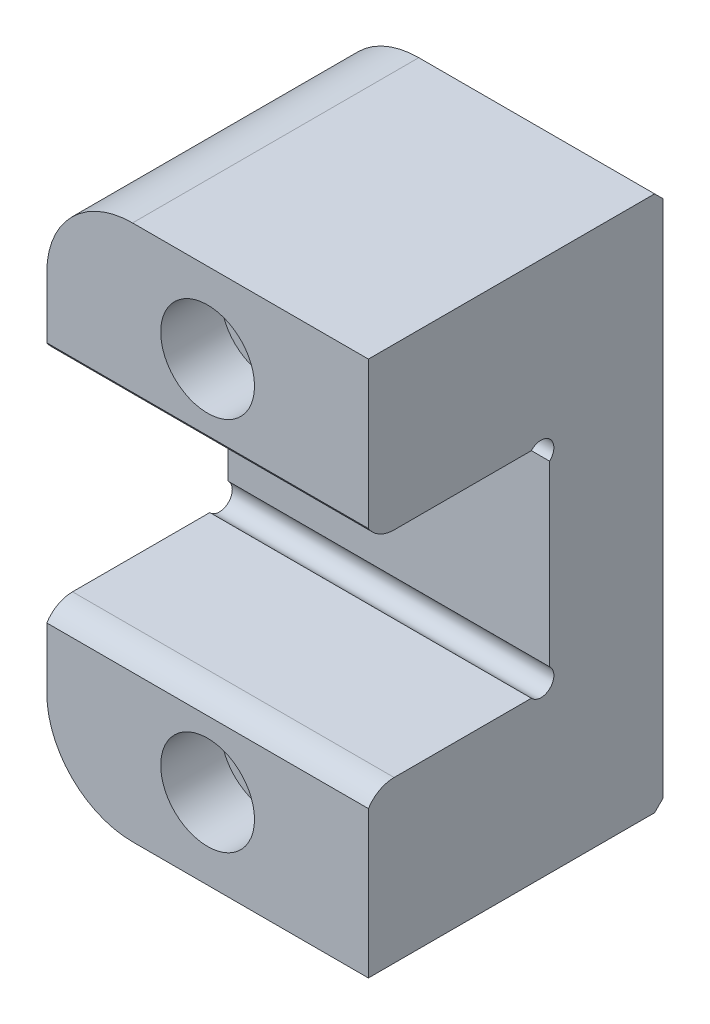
ISO-10303-21;
HEADER;
FILE_DESCRIPTION(('STEP AP214'),'2;1');
FILE_NAME('part.step','',(''),(''),'','','');
FILE_SCHEMA(('AUTOMOTIVE_DESIGN { 1 0 10303 214 1 1 1 1 }'));
ENDSEC;
DATA;
#1=APPLICATION_CONTEXT('core data for automotive mechanical design processes');
#2=APPLICATION_PROTOCOL_DEFINITION('international standard','automotive_design',2000,#1);
#3=PRODUCT_CONTEXT('',#1,'mechanical');
#4=PRODUCT('Part','Part','',(#3));
#5=PRODUCT_RELATED_PRODUCT_CATEGORY('part','',(#4));
#6=PRODUCT_DEFINITION_FORMATION('','',#4);
#7=PRODUCT_DEFINITION_CONTEXT('part definition',#1,'design');
#8=PRODUCT_DEFINITION('design','',#6,#7);
#9=PRODUCT_DEFINITION_SHAPE('','',#8);
#10=(LENGTH_UNIT() NAMED_UNIT(*) SI_UNIT(.MILLI.,.METRE.));
#11=(NAMED_UNIT(*) PLANE_ANGLE_UNIT() SI_UNIT($,.RADIAN.));
#12=(NAMED_UNIT(*) SI_UNIT($,.STERADIAN.) SOLID_ANGLE_UNIT());
#13=UNCERTAINTY_MEASURE_WITH_UNIT(LENGTH_MEASURE(1.E-05),#10,'distance_accuracy_value','');
#14=(GEOMETRIC_REPRESENTATION_CONTEXT(3) GLOBAL_UNCERTAINTY_ASSIGNED_CONTEXT((#13)) GLOBAL_UNIT_ASSIGNED_CONTEXT((#10,
#11,#12)) REPRESENTATION_CONTEXT('',''));
#15=CARTESIAN_POINT('',(0.,0.,0.));
#16=DIRECTION('',(0.,0.,1.));
#17=DIRECTION('',(1.,0.,0.));
#18=AXIS2_PLACEMENT_3D('',#15,#16,#17);
#19=CARTESIAN_POINT('',(19.05,12.7,-21.463));
#20=DIRECTION('',(0.,0.,-1.));
#21=DIRECTION('',(-1.,0.,0.));
#22=AXIS2_PLACEMENT_3D('',#19,#20,#21);
#23=PLANE('',#22);
#24=DIRECTION('',(-0.866025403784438,0.500000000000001,0.));
#25=VECTOR('',#24,1.);
#26=CARTESIAN_POINT('',(6.77536934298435,-8.56028394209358,-21.463));
#27=LINE('',#26,#25);
#28=CARTESIAN_POINT('',(-16.4416135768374,4.84404739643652,-21.463));
#29=VERTEX_POINT('',#28);
#30=CARTESIAN_POINT('',(-19.05,6.35,-21.463));
#31=VERTEX_POINT('',#30);
#32=EDGE_CURVE('E340',#29,#31,#27,.T.);
#33=ORIENTED_EDGE('',*,*,#32,.F.);
#34=DIRECTION('',(0.,-1.,0.));
#35=VECTOR('',#34,1.);
#36=CARTESIAN_POINT('',(-16.4416135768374,-5.43345644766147,-21.463));
#37=LINE('',#36,#35);
#38=CARTESIAN_POINT('',(-16.4416135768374,-4.84404739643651,-21.463));
#39=VERTEX_POINT('',#38);
#40=EDGE_CURVE('E255',#29,#39,#37,.T.);
#41=ORIENTED_EDGE('',*,*,#40,.T.);
#42=DIRECTION('',(0.866025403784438,0.500000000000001,0.));
#43=VECTOR('',#42,1.);
#44=CARTESIAN_POINT('',(17.7738919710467,14.9102839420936,-21.463));
#45=LINE('',#44,#43);
#46=CARTESIAN_POINT('',(-19.05,-6.35,-21.463));
#47=VERTEX_POINT('',#46);
#48=EDGE_CURVE('E338',#47,#39,#45,.T.);
#49=ORIENTED_EDGE('',*,*,#48,.F.);
#50=DIRECTION('',(0.,-1.,0.));
#51=VECTOR('',#50,1.);
#52=CARTESIAN_POINT('',(-19.05,12.7,-21.463));
#53=LINE('',#52,#51);
#54=CARTESIAN_POINT('',(-19.05,-10.5480774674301,-21.463));
#55=VERTEX_POINT('',#54);
#56=EDGE_CURVE('E221',#47,#55,#53,.T.);
#57=ORIENTED_EDGE('',*,*,#56,.T.);
#58=DIRECTION('',(1.,0.,0.));
#59=VECTOR('',#58,1.);
#60=CARTESIAN_POINT('',(-19.05,-10.5480774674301,-21.463));
#61=LINE('',#60,#59);
#62=CARTESIAN_POINT('',(19.05,-10.5480774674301,-21.463));
#63=VERTEX_POINT('',#62);
#64=EDGE_CURVE('E194',#55,#63,#61,.T.);
#65=ORIENTED_EDGE('',*,*,#64,.T.);
#66=DIRECTION('',(0.,-1.,0.));
#67=VECTOR('',#66,1.);
#68=CARTESIAN_POINT('',(19.05,12.7,-21.463));
#69=LINE('',#68,#67);
#70=CARTESIAN_POINT('',(19.05,10.5480774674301,-21.463));
#71=VERTEX_POINT('',#70);
#72=EDGE_CURVE('E348',#71,#63,#69,.T.);
#73=ORIENTED_EDGE('',*,*,#72,.F.);
#74=DIRECTION('',(1.,0.,0.));
#75=VECTOR('',#74,1.);
#76=CARTESIAN_POINT('',(-19.05,10.5480774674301,-21.463));
#77=LINE('',#76,#75);
#78=CARTESIAN_POINT('',(-19.05,10.5480774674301,-21.463));
#79=VERTEX_POINT('',#78);
#80=EDGE_CURVE('E416',#71,#79,#77,.F.);
#81=ORIENTED_EDGE('',*,*,#80,.T.);
#82=EDGE_CURVE('E215',#79,#31,#53,.T.);
#83=ORIENTED_EDGE('',*,*,#82,.T.);
#84=EDGE_LOOP('',(#33,#41,#49,#57,#65,#73,#81,#83));
#85=FACE_BOUND('',#84,.T.);
#86=ADVANCED_FACE('F32',(#85),#23,.F.);
#87=CARTESIAN_POINT('',(19.05,31.75,-34.925));
#88=DIRECTION('',(0.,0.,1.));
#89=DIRECTION('',(1.,0.,0.));
#90=AXIS2_PLACEMENT_3D('',#87,#88,#89);
#91=PLANE('',#90);
#92=CARTESIAN_POINT('',(0.,22.225,-34.925));
#93=DIRECTION('',(0.,0.,1.));
#94=DIRECTION('',(1.,0.,0.));
#95=AXIS2_PLACEMENT_3D('',#92,#93,#94);
#96=CIRCLE('',#95,3.57123999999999);
#97=CARTESIAN_POINT('',(3.57123999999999,22.225,-34.925));
#98=VERTEX_POINT('',#97);
#99=EDGE_CURVE('E723',#98,#98,#96,.T.);
#100=ORIENTED_EDGE('',*,*,#99,.T.);
#101=EDGE_LOOP('',(#100));
#102=FACE_BOUND('',#101,.T.);
#103=CARTESIAN_POINT('',(0.,-22.225,-34.925));
#104=DIRECTION('',(0.,0.,1.));
#105=DIRECTION('',(1.,0.,0.));
#106=AXIS2_PLACEMENT_3D('',#103,#104,#105);
#107=CIRCLE('',#106,3.57123999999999);
#108=CARTESIAN_POINT('',(3.57123999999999,-22.225,-34.925));
#109=VERTEX_POINT('',#108);
#110=EDGE_CURVE('E709',#109,#109,#107,.T.);
#111=ORIENTED_EDGE('',*,*,#110,.T.);
#112=EDGE_LOOP('',(#111));
#113=FACE_BOUND('',#112,.T.);
#114=CARTESIAN_POINT('',(-8.89,-21.59,-34.925));
#115=DIRECTION('',(0.,0.,1.));
#116=DIRECTION('',(1.,0.,0.));
#117=AXIS2_PLACEMENT_3D('',#114,#115,#116);
#118=CIRCLE('',#117,9.14400000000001);
#119=CARTESIAN_POINT('',(-8.89,-30.734,-34.925));
#120=VERTEX_POINT('',#119);
#121=CARTESIAN_POINT('',(-18.034,-21.59,-34.925));
#122=VERTEX_POINT('',#121);
#123=EDGE_CURVE('E271',#120,#122,#118,.F.);
#124=ORIENTED_EDGE('',*,*,#123,.T.);
#125=DIRECTION('',(0.,1.,0.));
#126=VECTOR('',#125,1.);
#127=CARTESIAN_POINT('',(-18.034,-6.35,-34.925));
#128=LINE('',#127,#126);
#129=CARTESIAN_POINT('',(-18.034,-5.76341212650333,-34.925));
#130=VERTEX_POINT('',#129);
#131=EDGE_CURVE('E273',#122,#130,#128,.T.);
#132=ORIENTED_EDGE('',*,*,#131,.T.);
#133=DIRECTION('',(0.866025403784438,0.500000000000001,0.));
#134=VECTOR('',#133,1.);
#135=CARTESIAN_POINT('',(-17.4625,-5.43345644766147,-34.925));
#136=LINE('',#135,#134);
#137=CARTESIAN_POINT('',(-17.4625,-5.43345644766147,-34.925));
#138=VERTEX_POINT('',#137);
#139=EDGE_CURVE('E324',#130,#138,#136,.T.);
#140=ORIENTED_EDGE('',*,*,#139,.T.);
#141=DIRECTION('',(0.,1.,0.));
#142=VECTOR('',#141,1.);
#143=CARTESIAN_POINT('',(-17.4625,5.43345644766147,-34.925));
#144=LINE('',#143,#142);
#145=CARTESIAN_POINT('',(-17.4625,5.43345644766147,-34.925));
#146=VERTEX_POINT('',#145);
#147=EDGE_CURVE('E323',#138,#146,#144,.T.);
#148=ORIENTED_EDGE('',*,*,#147,.T.);
#149=DIRECTION('',(-0.866025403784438,0.500000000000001,0.));
#150=VECTOR('',#149,1.);
#151=CARTESIAN_POINT('',(-17.4625,5.43345644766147,-34.925));
#152=LINE('',#151,#150);
#153=CARTESIAN_POINT('',(-18.034,5.76341212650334,-34.925));
#154=VERTEX_POINT('',#153);
#155=EDGE_CURVE('E317',#146,#154,#152,.T.);
#156=ORIENTED_EDGE('',*,*,#155,.T.);
#157=DIRECTION('',(0.,1.,0.));
#158=VECTOR('',#157,1.);
#159=CARTESIAN_POINT('',(-18.034,21.59,-34.925));
#160=LINE('',#159,#158);
#161=CARTESIAN_POINT('',(-18.034,21.59,-34.925));
#162=VERTEX_POINT('',#161);
#163=EDGE_CURVE('E265',#154,#162,#160,.T.);
#164=ORIENTED_EDGE('',*,*,#163,.T.);
#165=CARTESIAN_POINT('',(-8.89,21.59,-34.925));
#166=DIRECTION('',(0.,0.,1.));
#167=DIRECTION('',(1.,0.,0.));
#168=AXIS2_PLACEMENT_3D('',#165,#166,#167);
#169=CIRCLE('',#168,9.144);
#170=CARTESIAN_POINT('',(-8.89,30.734,-34.925));
#171=VERTEX_POINT('',#170);
#172=EDGE_CURVE('E263',#162,#171,#169,.F.);
#173=ORIENTED_EDGE('',*,*,#172,.T.);
#174=DIRECTION('',(1.,0.,0.));
#175=VECTOR('',#174,1.);
#176=CARTESIAN_POINT('',(19.05,30.734,-34.925));
#177=LINE('',#176,#175);
#178=CARTESIAN_POINT('',(19.05,30.734,-34.925));
#179=VERTEX_POINT('',#178);
#180=EDGE_CURVE('E267',#171,#179,#177,.T.);
#181=ORIENTED_EDGE('',*,*,#180,.T.);
#182=DIRECTION('',(0.,1.,0.));
#183=VECTOR('',#182,1.);
#184=CARTESIAN_POINT('',(19.05,31.75,-34.925));
#185=LINE('',#184,#183);
#186=CARTESIAN_POINT('',(19.05,-30.734,-34.925));
#187=VERTEX_POINT('',#186);
#188=EDGE_CURVE('E357',#187,#179,#185,.T.);
#189=ORIENTED_EDGE('',*,*,#188,.F.);
#190=DIRECTION('',(-1.,0.,0.));
#191=VECTOR('',#190,1.);
#192=CARTESIAN_POINT('',(19.05,-30.734,-34.925));
#193=LINE('',#192,#191);
#194=EDGE_CURVE('E269',#187,#120,#193,.T.);
#195=ORIENTED_EDGE('',*,*,#194,.T.);
#196=EDGE_LOOP('',(#124,#132,#140,#148,#156,#164,#173,#181,#189,#195));
#197=FACE_BOUND('',#196,.T.);
#198=ADVANCED_FACE('F321',(#102,#113,#197),#91,.F.);
#199=CARTESIAN_POINT('',(-19.05,-12.7,0.));
#200=DIRECTION('',(-1.,0.,0.));
#201=DIRECTION('',(0.,0.,1.));
#202=AXIS2_PLACEMENT_3D('',#199,#200,#201);
#203=PLANE('',#202);
#204=DIRECTION('',(0.,0.,1.));
#205=VECTOR('',#204,1.);
#206=CARTESIAN_POINT('',(-19.05,21.59,-34.925));
#207=LINE('',#206,#205);
#208=CARTESIAN_POINT('',(-19.05,21.59,0.));
#209=VERTEX_POINT('',#208);
#210=CARTESIAN_POINT('',(-19.05,21.59,-33.909));
#211=VERTEX_POINT('',#210);
#212=EDGE_CURVE('E235',#209,#211,#207,.F.);
#213=ORIENTED_EDGE('',*,*,#212,.T.);
#214=DIRECTION('',(0.,-1.,0.));
#215=VECTOR('',#214,1.);
#216=CARTESIAN_POINT('',(-19.05,6.35,-33.909));
#217=LINE('',#216,#215);
#218=CARTESIAN_POINT('',(-19.05,6.35,-33.909));
#219=VERTEX_POINT('',#218);
#220=EDGE_CURVE('E49',#211,#219,#217,.T.);
#221=ORIENTED_EDGE('',*,*,#220,.T.);
#222=DIRECTION('',(0.,0.,1.));
#223=VECTOR('',#222,1.);
#224=CARTESIAN_POINT('',(-19.05,6.35,0.));
#225=LINE('',#224,#223);
#226=EDGE_CURVE('E247',#219,#31,#225,.T.);
#227=ORIENTED_EDGE('',*,*,#226,.T.);
#228=ORIENTED_EDGE('',*,*,#82,.F.);
#229=CARTESIAN_POINT('',(-19.05,11.684,-20.447));
#230=DIRECTION('',(1.,0.,0.));
#231=DIRECTION('',(0.,0.,-1.));
#232=AXIS2_PLACEMENT_3D('',#229,#230,#231);
#233=CIRCLE('',#232,1.524);
#234=CARTESIAN_POINT('',(-19.05,12.7,-19.3110774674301));
#235=VERTEX_POINT('',#234);
#236=EDGE_CURVE('E423',#79,#235,#233,.T.);
#237=ORIENTED_EDGE('',*,*,#236,.T.);
#238=DIRECTION('',(0.,0.,-1.));
#239=VECTOR('',#238,1.);
#240=CARTESIAN_POINT('',(-19.05,12.7,0.));
#241=LINE('',#240,#239);
#242=CARTESIAN_POINT('',(-19.05,12.7,-3.04799999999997));
#243=VERTEX_POINT('',#242);
#244=EDGE_CURVE('E362',#243,#235,#241,.T.);
#245=ORIENTED_EDGE('',*,*,#244,.F.);
#246=CARTESIAN_POINT('',(-19.05,16.3159644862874,-3.04799999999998));
#247=DIRECTION('',(-1.,0.,0.));
#248=DIRECTION('',(0.,0.,-1.));
#249=AXIS2_PLACEMENT_3D('',#246,#247,#248);
#250=CIRCLE('',#249,3.6159644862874);
#251=CARTESIAN_POINT('',(-19.05,14.3704837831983,0.));
#252=VERTEX_POINT('',#251);
#253=EDGE_CURVE('E415',#243,#252,#250,.T.);
#254=ORIENTED_EDGE('',*,*,#253,.T.);
#255=DIRECTION('',(0.,-1.,0.));
#256=VECTOR('',#255,1.);
#257=CARTESIAN_POINT('',(-19.05,31.75,0.));
#258=LINE('',#257,#256);
#259=EDGE_CURVE('E342',#209,#252,#258,.T.);
#260=ORIENTED_EDGE('',*,*,#259,.F.);
#261=EDGE_LOOP('',(#213,#221,#227,#228,#237,#245,#254,#260));
#262=FACE_BOUND('',#261,.T.);
#263=ADVANCED_FACE('F459',(#262),#203,.T.);
#264=DIRECTION('',(0.,0.,-1.));
#265=VECTOR('',#264,1.);
#266=CARTESIAN_POINT('',(-19.05,-6.35,0.));
#267=LINE('',#266,#265);
#268=CARTESIAN_POINT('',(-19.05,-6.35,-33.909));
#269=VERTEX_POINT('',#268);
#270=EDGE_CURVE('E245',#47,#269,#267,.T.);
#271=ORIENTED_EDGE('',*,*,#270,.T.);
#272=DIRECTION('',(0.,-1.,0.));
#273=VECTOR('',#272,1.);
#274=CARTESIAN_POINT('',(-19.05,-21.59,-33.909));
#275=LINE('',#274,#273);
#276=CARTESIAN_POINT('',(-19.05,-21.59,-33.909));
#277=VERTEX_POINT('',#276);
#278=EDGE_CURVE('E278',#269,#277,#275,.T.);
#279=ORIENTED_EDGE('',*,*,#278,.T.);
#280=DIRECTION('',(0.,0.,-1.));
#281=VECTOR('',#280,1.);
#282=CARTESIAN_POINT('',(-19.05,-21.59,0.));
#283=LINE('',#282,#281);
#284=CARTESIAN_POINT('',(-19.05,-21.59,0.));
#285=VERTEX_POINT('',#284);
#286=EDGE_CURVE('E237',#277,#285,#283,.F.);
#287=ORIENTED_EDGE('',*,*,#286,.T.);
#288=DIRECTION('',(0.,-1.,0.));
#289=VECTOR('',#288,1.);
#290=CARTESIAN_POINT('',(-19.05,-12.7,0.));
#291=LINE('',#290,#289);
#292=CARTESIAN_POINT('',(-19.05,-14.3704837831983,0.));
#293=VERTEX_POINT('',#292);
#294=EDGE_CURVE('E214',#293,#285,#291,.T.);
#295=ORIENTED_EDGE('',*,*,#294,.F.);
#296=CARTESIAN_POINT('',(-19.05,-16.3159644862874,-3.04799999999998));
#297=DIRECTION('',(-1.,0.,0.));
#298=DIRECTION('',(0.,0.,1.));
#299=AXIS2_PLACEMENT_3D('',#296,#297,#298);
#300=CIRCLE('',#299,3.6159644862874);
#301=CARTESIAN_POINT('',(-19.05,-12.7,-3.04799999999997));
#302=VERTEX_POINT('',#301);
#303=EDGE_CURVE('E213',#293,#302,#300,.T.);
#304=ORIENTED_EDGE('',*,*,#303,.T.);
#305=DIRECTION('',(0.,0.,1.));
#306=VECTOR('',#305,1.);
#307=CARTESIAN_POINT('',(-19.05,-12.7,-21.463));
#308=LINE('',#307,#306);
#309=CARTESIAN_POINT('',(-19.05,-12.7,-19.3110774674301));
#310=VERTEX_POINT('',#309);
#311=EDGE_CURVE('E205',#310,#302,#308,.T.);
#312=ORIENTED_EDGE('',*,*,#311,.F.);
#313=CARTESIAN_POINT('',(-19.05,-11.684,-20.447));
#314=DIRECTION('',(1.,0.,0.));
#315=DIRECTION('',(0.,0.,1.));
#316=AXIS2_PLACEMENT_3D('',#313,#314,#315);
#317=CIRCLE('',#316,1.524);
#318=EDGE_CURVE('E188',#310,#55,#317,.T.);
#319=ORIENTED_EDGE('',*,*,#318,.T.);
#320=ORIENTED_EDGE('',*,*,#56,.F.);
#321=EDGE_LOOP('',(#271,#279,#287,#295,#304,#312,#319,#320));
#322=FACE_BOUND('',#321,.T.);
#323=ADVANCED_FACE('F211',(#322),#203,.T.);
#324=CARTESIAN_POINT('',(19.05,31.75,0.));
#325=DIRECTION('',(0.,0.,-1.));
#326=DIRECTION('',(0.,1.,0.));
#327=AXIS2_PLACEMENT_3D('',#324,#325,#326);
#328=PLANE('',#327);
#329=CARTESIAN_POINT('',(0.,22.225,0.));
#330=DIRECTION('',(0.,0.,1.));
#331=DIRECTION('',(1.,0.,0.));
#332=AXIS2_PLACEMENT_3D('',#329,#330,#331);
#333=CIRCLE('',#332,5.55625);
#334=CARTESIAN_POINT('',(5.55625,22.225,0.));
#335=VERTEX_POINT('',#334);
#336=EDGE_CURVE('E298',#335,#335,#333,.T.);
#337=ORIENTED_EDGE('',*,*,#336,.F.);
#338=EDGE_LOOP('',(#337));
#339=FACE_BOUND('',#338,.T.);
#340=ORIENTED_EDGE('',*,*,#259,.T.);
#341=DIRECTION('',(1.,0.,0.));
#342=VECTOR('',#341,1.);
#343=CARTESIAN_POINT('',(-19.05,14.3704837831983,0.));
#344=LINE('',#343,#342);
#345=CARTESIAN_POINT('',(19.05,14.3704837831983,0.));
#346=VERTEX_POINT('',#345);
#347=EDGE_CURVE('E410',#252,#346,#344,.T.);
#348=ORIENTED_EDGE('',*,*,#347,.T.);
#349=DIRECTION('',(0.,-1.,0.));
#350=VECTOR('',#349,1.);
#351=CARTESIAN_POINT('',(19.05,31.75,0.));
#352=LINE('',#351,#350);
#353=CARTESIAN_POINT('',(19.05,31.75,0.));
#354=VERTEX_POINT('',#353);
#355=EDGE_CURVE('E218',#354,#346,#352,.T.);
#356=ORIENTED_EDGE('',*,*,#355,.F.);
#357=DIRECTION('',(-1.,0.,0.));
#358=VECTOR('',#357,1.);
#359=CARTESIAN_POINT('',(19.05,31.75,0.));
#360=LINE('',#359,#358);
#361=CARTESIAN_POINT('',(-8.88999999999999,31.75,0.));
#362=VERTEX_POINT('',#361);
#363=EDGE_CURVE('E225',#354,#362,#360,.T.);
#364=ORIENTED_EDGE('',*,*,#363,.T.);
#365=CARTESIAN_POINT('',(-8.89,21.59,0.));
#366=DIRECTION('',(0.,0.,-1.));
#367=DIRECTION('',(0.,1.,0.));
#368=AXIS2_PLACEMENT_3D('',#365,#366,#367);
#369=CIRCLE('',#368,10.16);
#370=EDGE_CURVE('E243',#362,#209,#369,.F.);
#371=ORIENTED_EDGE('',*,*,#370,.T.);
#372=EDGE_LOOP('',(#340,#348,#356,#364,#371));
#373=FACE_BOUND('',#372,.T.);
#374=ADVANCED_FACE('F409',(#339,#373),#328,.F.);
#375=CARTESIAN_POINT('',(19.05,12.7,0.));
#376=DIRECTION('',(0.,1.,0.));
#377=DIRECTION('',(0.,0.,1.));
#378=AXIS2_PLACEMENT_3D('',#375,#376,#377);
#379=PLANE('',#378);
#380=ORIENTED_EDGE('',*,*,#244,.T.);
#381=DIRECTION('',(1.,0.,0.));
#382=VECTOR('',#381,1.);
#383=CARTESIAN_POINT('',(-19.05,12.7,-19.3110774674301));
#384=LINE('',#383,#382);
#385=CARTESIAN_POINT('',(19.05,12.7,-19.3110774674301));
#386=VERTEX_POINT('',#385);
#387=EDGE_CURVE('E420',#235,#386,#384,.T.);
#388=ORIENTED_EDGE('',*,*,#387,.T.);
#389=DIRECTION('',(0.,0.,-1.));
#390=VECTOR('',#389,1.);
#391=CARTESIAN_POINT('',(19.05,12.7,0.));
#392=LINE('',#391,#390);
#393=CARTESIAN_POINT('',(19.05,12.7,-3.04799999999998));
#394=VERTEX_POINT('',#393);
#395=EDGE_CURVE('E345',#394,#386,#392,.T.);
#396=ORIENTED_EDGE('',*,*,#395,.F.);
#397=DIRECTION('',(1.,0.,0.));
#398=VECTOR('',#397,1.);
#399=CARTESIAN_POINT('',(-19.05,12.7,-3.04799999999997));
#400=LINE('',#399,#398);
#401=EDGE_CURVE('E419',#243,#394,#400,.T.);
#402=ORIENTED_EDGE('',*,*,#401,.F.);
#403=EDGE_LOOP('',(#380,#388,#396,#402));
#404=FACE_BOUND('',#403,.T.);
#405=ADVANCED_FACE('F418',(#404),#379,.F.);
#406=CARTESIAN_POINT('',(19.05,-12.7,-21.463));
#407=DIRECTION('',(0.,-1.,0.));
#408=DIRECTION('',(0.,0.,-1.));
#409=AXIS2_PLACEMENT_3D('',#406,#407,#408);
#410=PLANE('',#409);
#411=DIRECTION('',(0.,0.,1.));
#412=VECTOR('',#411,1.);
#413=CARTESIAN_POINT('',(19.05,-12.7,-21.463));
#414=LINE('',#413,#412);
#415=CARTESIAN_POINT('',(19.05,-12.7,-19.3110774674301));
#416=VERTEX_POINT('',#415);
#417=CARTESIAN_POINT('',(19.05,-12.7,-3.04799999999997));
#418=VERTEX_POINT('',#417);
#419=EDGE_CURVE('E207',#416,#418,#414,.T.);
#420=ORIENTED_EDGE('',*,*,#419,.F.);
#421=DIRECTION('',(1.,0.,0.));
#422=VECTOR('',#421,1.);
#423=CARTESIAN_POINT('',(-19.05,-12.7,-19.3110774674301));
#424=LINE('',#423,#422);
#425=EDGE_CURVE('E191',#416,#310,#424,.F.);
#426=ORIENTED_EDGE('',*,*,#425,.T.);
#427=ORIENTED_EDGE('',*,*,#311,.T.);
#428=DIRECTION('',(1.,0.,0.));
#429=VECTOR('',#428,1.);
#430=CARTESIAN_POINT('',(-19.05,-12.7,-3.04799999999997));
#431=LINE('',#430,#429);
#432=EDGE_CURVE('E328',#302,#418,#431,.T.);
#433=ORIENTED_EDGE('',*,*,#432,.T.);
#434=EDGE_LOOP('',(#420,#426,#427,#433));
#435=FACE_BOUND('',#434,.T.);
#436=ADVANCED_FACE('F203',(#435),#410,.F.);
#437=CARTESIAN_POINT('',(19.05,-12.7,0.));
#438=DIRECTION('',(0.,0.,-1.));
#439=DIRECTION('',(0.,1.,0.));
#440=AXIS2_PLACEMENT_3D('',#437,#438,#439);
#441=PLANE('',#440);
#442=CARTESIAN_POINT('',(0.,-22.225,0.));
#443=DIRECTION('',(0.,0.,1.));
#444=DIRECTION('',(1.,0.,0.));
#445=AXIS2_PLACEMENT_3D('',#442,#443,#444);
#446=CIRCLE('',#445,5.55625);
#447=CARTESIAN_POINT('',(5.55625,-22.225,0.));
#448=VERTEX_POINT('',#447);
#449=EDGE_CURVE('E720',#448,#448,#446,.T.);
#450=ORIENTED_EDGE('',*,*,#449,.F.);
#451=EDGE_LOOP('',(#450));
#452=FACE_BOUND('',#451,.T.);
#453=DIRECTION('',(0.,-1.,0.));
#454=VECTOR('',#453,1.);
#455=CARTESIAN_POINT('',(19.05,-12.7,0.));
#456=LINE('',#455,#454);
#457=CARTESIAN_POINT('',(19.05,-14.3704837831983,0.));
#458=VERTEX_POINT('',#457);
#459=CARTESIAN_POINT('',(19.05,-31.75,0.));
#460=VERTEX_POINT('',#459);
#461=EDGE_CURVE('E352',#458,#460,#456,.T.);
#462=ORIENTED_EDGE('',*,*,#461,.F.);
#463=DIRECTION('',(1.,0.,0.));
#464=VECTOR('',#463,1.);
#465=CARTESIAN_POINT('',(-19.05,-14.3704837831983,0.));
#466=LINE('',#465,#464);
#467=EDGE_CURVE('E325',#293,#458,#466,.T.);
#468=ORIENTED_EDGE('',*,*,#467,.F.);
#469=ORIENTED_EDGE('',*,*,#294,.T.);
#470=CARTESIAN_POINT('',(-8.89,-21.59,0.));
#471=DIRECTION('',(0.,0.,-1.));
#472=DIRECTION('',(0.,1.,0.));
#473=AXIS2_PLACEMENT_3D('',#470,#471,#472);
#474=CIRCLE('',#473,10.16);
#475=CARTESIAN_POINT('',(-8.88999999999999,-31.75,0.));
#476=VERTEX_POINT('',#475);
#477=EDGE_CURVE('E239',#285,#476,#474,.F.);
#478=ORIENTED_EDGE('',*,*,#477,.T.);
#479=DIRECTION('',(-1.,0.,0.));
#480=VECTOR('',#479,1.);
#481=CARTESIAN_POINT('',(19.05,-31.75,0.));
#482=LINE('',#481,#480);
#483=EDGE_CURVE('E228',#460,#476,#482,.T.);
#484=ORIENTED_EDGE('',*,*,#483,.F.);
#485=EDGE_LOOP('',(#462,#468,#469,#478,#484));
#486=FACE_BOUND('',#485,.T.);
#487=ADVANCED_FACE('F443',(#452,#486),#441,.F.);
#488=CARTESIAN_POINT('',(19.05,-31.75,0.));
#489=DIRECTION('',(0.,1.,0.));
#490=DIRECTION('',(0.,0.,1.));
#491=AXIS2_PLACEMENT_3D('',#488,#489,#490);
#492=PLANE('',#491);
#493=DIRECTION('',(0.,0.,-1.));
#494=VECTOR('',#493,1.);
#495=CARTESIAN_POINT('',(-8.89,-31.75,-34.925));
#496=LINE('',#495,#494);
#497=CARTESIAN_POINT('',(-8.89,-31.75,-33.909));
#498=VERTEX_POINT('',#497);
#499=EDGE_CURVE('E232',#476,#498,#496,.T.);
#500=ORIENTED_EDGE('',*,*,#499,.T.);
#501=DIRECTION('',(1.,0.,0.));
#502=VECTOR('',#501,1.);
#503=CARTESIAN_POINT('',(19.05,-31.75,-33.909));
#504=LINE('',#503,#502);
#505=CARTESIAN_POINT('',(19.05,-31.75,-33.909));
#506=VERTEX_POINT('',#505);
#507=EDGE_CURVE('E282',#498,#506,#504,.T.);
#508=ORIENTED_EDGE('',*,*,#507,.T.);
#509=DIRECTION('',(0.,0.,-1.));
#510=VECTOR('',#509,1.);
#511=CARTESIAN_POINT('',(19.05,-31.75,0.));
#512=LINE('',#511,#510);
#513=EDGE_CURVE('E354',#460,#506,#512,.T.);
#514=ORIENTED_EDGE('',*,*,#513,.F.);
#515=ORIENTED_EDGE('',*,*,#483,.T.);
#516=EDGE_LOOP('',(#500,#508,#514,#515));
#517=FACE_BOUND('',#516,.T.);
#518=ADVANCED_FACE('F389',(#517),#492,.F.);
#519=CARTESIAN_POINT('',(19.05,31.75,0.));
#520=DIRECTION('',(0.,-1.,0.));
#521=DIRECTION('',(0.,0.,-1.));
#522=AXIS2_PLACEMENT_3D('',#519,#520,#521);
#523=PLANE('',#522);
#524=DIRECTION('',(0.,0.,1.));
#525=VECTOR('',#524,1.);
#526=CARTESIAN_POINT('',(19.05,31.75,0.));
#527=LINE('',#526,#525);
#528=CARTESIAN_POINT('',(19.05,31.75,-33.9089999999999));
#529=VERTEX_POINT('',#528);
#530=EDGE_CURVE('E229',#529,#354,#527,.T.);
#531=ORIENTED_EDGE('',*,*,#530,.F.);
#532=DIRECTION('',(-1.,0.,0.));
#533=VECTOR('',#532,1.);
#534=CARTESIAN_POINT('',(19.05,31.75,-33.909));
#535=LINE('',#534,#533);
#536=CARTESIAN_POINT('',(-8.89,31.75,-33.909));
#537=VERTEX_POINT('',#536);
#538=EDGE_CURVE('E288',#529,#537,#535,.T.);
#539=ORIENTED_EDGE('',*,*,#538,.T.);
#540=DIRECTION('',(0.,0.,1.));
#541=VECTOR('',#540,1.);
#542=CARTESIAN_POINT('',(-8.89,31.75,0.));
#543=LINE('',#542,#541);
#544=EDGE_CURVE('E241',#537,#362,#543,.T.);
#545=ORIENTED_EDGE('',*,*,#544,.T.);
#546=ORIENTED_EDGE('',*,*,#363,.F.);
#547=EDGE_LOOP('',(#531,#539,#545,#546));
#548=FACE_BOUND('',#547,.T.);
#549=ADVANCED_FACE('F404',(#548),#523,.F.);
#550=CARTESIAN_POINT('',(19.05,-12.7,0.));
#551=DIRECTION('',(-1.,0.,0.));
#552=DIRECTION('',(0.,0.,1.));
#553=AXIS2_PLACEMENT_3D('',#550,#551,#552);
#554=PLANE('',#553);
#555=ORIENTED_EDGE('',*,*,#513,.T.);
#556=DIRECTION('',(0.,-0.707106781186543,0.707106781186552));
#557=VECTOR('',#556,1.);
#558=CARTESIAN_POINT('',(19.05,-30.734,-34.925));
#559=LINE('',#558,#557);
#560=EDGE_CURVE('E286',#506,#187,#559,.F.);
#561=ORIENTED_EDGE('',*,*,#560,.T.);
#562=ORIENTED_EDGE('',*,*,#188,.T.);
#563=DIRECTION('',(0.,-0.70710678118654,-0.707106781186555));
#564=VECTOR('',#563,1.);
#565=CARTESIAN_POINT('',(19.05,31.75,-33.909));
#566=LINE('',#565,#564);
#567=EDGE_CURVE('E284',#179,#529,#566,.F.);
#568=ORIENTED_EDGE('',*,*,#567,.T.);
#569=ORIENTED_EDGE('',*,*,#530,.T.);
#570=ORIENTED_EDGE('',*,*,#355,.T.);
#571=CARTESIAN_POINT('',(19.05,16.3159644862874,-3.04799999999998));
#572=DIRECTION('',(-1.,0.,0.));
#573=DIRECTION('',(0.,0.,-1.));
#574=AXIS2_PLACEMENT_3D('',#571,#572,#573);
#575=CIRCLE('',#574,3.6159644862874);
#576=EDGE_CURVE('E412',#394,#346,#575,.T.);
#577=ORIENTED_EDGE('',*,*,#576,.F.);
#578=ORIENTED_EDGE('',*,*,#395,.T.);
#579=CARTESIAN_POINT('',(19.05,11.684,-20.447));
#580=DIRECTION('',(-1.,0.,0.));
#581=DIRECTION('',(0.,0.,1.));
#582=AXIS2_PLACEMENT_3D('',#579,#580,#581);
#583=CIRCLE('',#582,1.524);
#584=EDGE_CURVE('E249',#386,#71,#583,.T.);
#585=ORIENTED_EDGE('',*,*,#584,.T.);
#586=ORIENTED_EDGE('',*,*,#72,.T.);
#587=CARTESIAN_POINT('',(19.05,-11.684,-20.447));
#588=DIRECTION('',(1.,0.,0.));
#589=DIRECTION('',(0.,0.,1.));
#590=AXIS2_PLACEMENT_3D('',#587,#588,#589);
#591=CIRCLE('',#590,1.524);
#592=EDGE_CURVE('E199',#416,#63,#591,.T.);
#593=ORIENTED_EDGE('',*,*,#592,.F.);
#594=ORIENTED_EDGE('',*,*,#419,.T.);
#595=CARTESIAN_POINT('',(19.05,-16.3159644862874,-3.04799999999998));
#596=DIRECTION('',(-1.,0.,0.));
#597=DIRECTION('',(0.,0.,1.));
#598=AXIS2_PLACEMENT_3D('',#595,#596,#597);
#599=CIRCLE('',#598,3.6159644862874);
#600=EDGE_CURVE('E433',#458,#418,#599,.T.);
#601=ORIENTED_EDGE('',*,*,#600,.F.);
#602=ORIENTED_EDGE('',*,*,#461,.T.);
#603=EDGE_LOOP('',(#555,#561,#562,#568,#569,#570,#577,#578,#585,#586,#593,#594,#601,#602));
#604=FACE_BOUND('',#603,.T.);
#605=ADVANCED_FACE('F398',(#604),#554,.F.);
#606=CARTESIAN_POINT('',(-8.89,-21.59,0.));
#607=DIRECTION('',(0.,0.,1.));
#608=DIRECTION('',(1.,0.,0.));
#609=AXIS2_PLACEMENT_3D('',#606,#607,#608);
#610=CYLINDRICAL_SURFACE('',#609,10.16);
#611=ORIENTED_EDGE('',*,*,#286,.F.);
#612=CARTESIAN_POINT('',(-8.89,-21.59,-33.909));
#613=DIRECTION('',(0.,0.,1.));
#614=DIRECTION('',(1.,0.,0.));
#615=AXIS2_PLACEMENT_3D('',#612,#613,#614);
#616=CIRCLE('',#615,10.16);
#617=EDGE_CURVE('E280',#277,#498,#616,.T.);
#618=ORIENTED_EDGE('',*,*,#617,.T.);
#619=ORIENTED_EDGE('',*,*,#499,.F.);
#620=ORIENTED_EDGE('',*,*,#477,.F.);
#621=EDGE_LOOP('',(#611,#618,#619,#620));
#622=FACE_BOUND('',#621,.T.);
#623=ADVANCED_FACE('F385',(#622),#610,.T.);
#624=CARTESIAN_POINT('',(-8.89,21.59,0.));
#625=DIRECTION('',(0.,0.,-1.));
#626=DIRECTION('',(-1.,0.,0.));
#627=AXIS2_PLACEMENT_3D('',#624,#625,#626);
#628=CYLINDRICAL_SURFACE('',#627,10.16);
#629=ORIENTED_EDGE('',*,*,#544,.F.);
#630=CARTESIAN_POINT('',(-8.89,21.59,-33.909));
#631=DIRECTION('',(0.,0.,1.));
#632=DIRECTION('',(1.,0.,0.));
#633=AXIS2_PLACEMENT_3D('',#630,#631,#632);
#634=CIRCLE('',#633,10.16);
#635=EDGE_CURVE('E11',#537,#211,#634,.T.);
#636=ORIENTED_EDGE('',*,*,#635,.T.);
#637=ORIENTED_EDGE('',*,*,#212,.F.);
#638=ORIENTED_EDGE('',*,*,#370,.F.);
#639=EDGE_LOOP('',(#629,#636,#637,#638));
#640=FACE_BOUND('',#639,.T.);
#641=ADVANCED_FACE('F470',(#640),#628,.T.);
#642=CARTESIAN_POINT('',(-17.4625,5.43345644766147,0.));
#643=DIRECTION('',(-1.,0.,0.));
#644=DIRECTION('',(0.,0.,1.));
#645=AXIS2_PLACEMENT_3D('',#642,#643,#644);
#646=PLANE('',#645);
#647=DIRECTION('',(0.,0.,-1.));
#648=VECTOR('',#647,1.);
#649=CARTESIAN_POINT('',(-17.4625,-5.43345644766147,0.));
#650=LINE('',#649,#648);
#651=CARTESIAN_POINT('',(-17.4625,-5.43345644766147,-25.2730000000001));
#652=VERTEX_POINT('',#651);
#653=EDGE_CURVE('E335',#652,#138,#650,.T.);
#654=ORIENTED_EDGE('',*,*,#653,.F.);
#655=DIRECTION('',(0.,1.,0.));
#656=VECTOR('',#655,1.);
#657=CARTESIAN_POINT('',(-17.4625,5.43345644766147,-25.2730000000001));
#658=LINE('',#657,#656);
#659=CARTESIAN_POINT('',(-17.4625,5.43345644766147,-25.2730000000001));
#660=VERTEX_POINT('',#659);
#661=EDGE_CURVE('E252',#652,#660,#658,.T.);
#662=ORIENTED_EDGE('',*,*,#661,.T.);
#663=DIRECTION('',(0.,0.,-1.));
#664=VECTOR('',#663,1.);
#665=CARTESIAN_POINT('',(-17.4625,5.43345644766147,0.));
#666=LINE('',#665,#664);
#667=EDGE_CURVE('E333',#660,#146,#666,.T.);
#668=ORIENTED_EDGE('',*,*,#667,.T.);
#669=ORIENTED_EDGE('',*,*,#147,.F.);
#670=EDGE_LOOP('',(#654,#662,#668,#669));
#671=FACE_BOUND('',#670,.T.);
#672=ADVANCED_FACE('F473',(#671),#646,.T.);
#673=CARTESIAN_POINT('',(-17.4625,5.43345644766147,0.));
#674=DIRECTION('',(-0.500000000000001,-0.866025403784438,0.));
#675=DIRECTION('',(0.866025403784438,-0.500000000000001,0.));
#676=AXIS2_PLACEMENT_3D('',#673,#674,#675);
#677=PLANE('',#676);
#678=ORIENTED_EDGE('',*,*,#226,.F.);
#679=DIRECTION('',(0.654653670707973,-0.377964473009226,-0.654653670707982));
#680=VECTOR('',#679,1.);
#681=CARTESIAN_POINT('',(-32.6752857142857,14.2165623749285,-20.283714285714));
#682=LINE('',#681,#680);
#683=EDGE_CURVE('E41',#219,#154,#682,.T.);
#684=ORIENTED_EDGE('',*,*,#683,.T.);
#685=ORIENTED_EDGE('',*,*,#155,.F.);
#686=ORIENTED_EDGE('',*,*,#667,.F.);
#687=DIRECTION('',(0.255976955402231,-0.147788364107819,0.955319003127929));
#688=VECTOR('',#687,1.);
#689=CARTESIAN_POINT('',(-17.4625,5.43345644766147,-25.2730000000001));
#690=LINE('',#689,#688);
#691=EDGE_CURVE('E258',#660,#29,#690,.T.);
#692=ORIENTED_EDGE('',*,*,#691,.T.);
#693=ORIENTED_EDGE('',*,*,#32,.T.);
#694=EDGE_LOOP('',(#678,#684,#685,#686,#692,#693));
#695=FACE_BOUND('',#694,.T.);
#696=ADVANCED_FACE('F315',(#695),#677,.T.);
#697=CARTESIAN_POINT('',(-17.4625,-5.43345644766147,0.));
#698=DIRECTION('',(-0.500000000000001,0.866025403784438,0.));
#699=DIRECTION('',(-0.866025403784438,-0.500000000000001,0.));
#700=AXIS2_PLACEMENT_3D('',#697,#698,#699);
#701=PLANE('',#700);
#702=ORIENTED_EDGE('',*,*,#139,.F.);
#703=DIRECTION('',(-0.654653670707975,-0.377964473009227,0.654653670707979));
#704=VECTOR('',#703,1.);
#705=CARTESIAN_POINT('',(-32.6752857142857,-14.2165623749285,-20.2837142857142));
#706=LINE('',#705,#704);
#707=EDGE_CURVE('E276',#130,#269,#706,.T.);
#708=ORIENTED_EDGE('',*,*,#707,.T.);
#709=ORIENTED_EDGE('',*,*,#270,.F.);
#710=ORIENTED_EDGE('',*,*,#48,.T.);
#711=DIRECTION('',(-0.255976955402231,-0.147788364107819,-0.955319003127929));
#712=VECTOR('',#711,1.);
#713=CARTESIAN_POINT('',(-17.0514001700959,-5.19610785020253,-23.738754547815));
#714=LINE('',#713,#712);
#715=EDGE_CURVE('E261',#39,#652,#714,.T.);
#716=ORIENTED_EDGE('',*,*,#715,.T.);
#717=ORIENTED_EDGE('',*,*,#653,.T.);
#718=EDGE_LOOP('',(#702,#708,#709,#710,#716,#717));
#719=FACE_BOUND('',#718,.T.);
#720=ADVANCED_FACE('F587',(#719),#701,.T.);
#721=CARTESIAN_POINT('',(-19.05,-16.3159644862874,-3.04799999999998));
#722=DIRECTION('',(1.,0.,0.));
#723=DIRECTION('',(0.,0.,-1.));
#724=AXIS2_PLACEMENT_3D('',#721,#722,#723);
#725=CYLINDRICAL_SURFACE('',#724,3.6159644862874);
#726=ORIENTED_EDGE('',*,*,#600,.T.);
#727=ORIENTED_EDGE('',*,*,#432,.F.);
#728=ORIENTED_EDGE('',*,*,#303,.F.);
#729=ORIENTED_EDGE('',*,*,#467,.T.);
#730=EDGE_LOOP('',(#726,#727,#728,#729));
#731=FACE_BOUND('',#730,.T.);
#732=ADVANCED_FACE('F439',(#731),#725,.T.);
#733=CARTESIAN_POINT('',(-19.05,16.3159644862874,-3.04799999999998));
#734=DIRECTION('',(1.,0.,0.));
#735=DIRECTION('',(0.,0.,-1.));
#736=AXIS2_PLACEMENT_3D('',#733,#734,#735);
#737=CYLINDRICAL_SURFACE('',#736,3.6159644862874);
#738=ORIENTED_EDGE('',*,*,#576,.T.);
#739=ORIENTED_EDGE('',*,*,#347,.F.);
#740=ORIENTED_EDGE('',*,*,#253,.F.);
#741=ORIENTED_EDGE('',*,*,#401,.T.);
#742=EDGE_LOOP('',(#738,#739,#740,#741));
#743=FACE_BOUND('',#742,.T.);
#744=ADVANCED_FACE('F572',(#743),#737,.T.);
#745=CARTESIAN_POINT('',(-19.05,11.684,-20.447));
#746=DIRECTION('',(1.,0.,0.));
#747=DIRECTION('',(0.,0.,-1.));
#748=AXIS2_PLACEMENT_3D('',#745,#746,#747);
#749=CYLINDRICAL_SURFACE('',#748,1.524);
#750=ORIENTED_EDGE('',*,*,#584,.F.);
#751=ORIENTED_EDGE('',*,*,#387,.F.);
#752=ORIENTED_EDGE('',*,*,#236,.F.);
#753=ORIENTED_EDGE('',*,*,#80,.F.);
#754=EDGE_LOOP('',(#750,#751,#752,#753));
#755=FACE_BOUND('',#754,.T.);
#756=ADVANCED_FACE('F564',(#755),#749,.F.);
#757=CARTESIAN_POINT('',(-19.05,-11.684,-20.447));
#758=DIRECTION('',(1.,0.,0.));
#759=DIRECTION('',(0.,0.,-1.));
#760=AXIS2_PLACEMENT_3D('',#757,#758,#759);
#761=CYLINDRICAL_SURFACE('',#760,1.524);
#762=ORIENTED_EDGE('',*,*,#318,.F.);
#763=ORIENTED_EDGE('',*,*,#425,.F.);
#764=ORIENTED_EDGE('',*,*,#592,.T.);
#765=ORIENTED_EDGE('',*,*,#64,.F.);
#766=EDGE_LOOP('',(#762,#763,#764,#765));
#767=FACE_BOUND('',#766,.T.);
#768=ADVANCED_FACE('F190',(#767),#761,.F.);
#769=CARTESIAN_POINT('',(0.,-22.225,0.));
#770=DIRECTION('',(0.,0.,1.));
#771=DIRECTION('',(1.,0.,0.));
#772=AXIS2_PLACEMENT_3D('',#769,#770,#771);
#773=CYLINDRICAL_SURFACE('',#772,3.57124);
#774=ORIENTED_EDGE('',*,*,#110,.F.);
#775=EDGE_LOOP('',(#774));
#776=FACE_BOUND('',#775,.T.);
#777=CARTESIAN_POINT('',(0.,-22.225,-7.14375));
#778=DIRECTION('',(0.,0.,1.));
#779=DIRECTION('',(1.,0.,0.));
#780=AXIS2_PLACEMENT_3D('',#777,#778,#779);
#781=CIRCLE('',#780,3.57124);
#782=CARTESIAN_POINT('',(3.57124,-22.225,-7.14375));
#783=VERTEX_POINT('',#782);
#784=EDGE_CURVE('E712',#783,#783,#781,.T.);
#785=ORIENTED_EDGE('',*,*,#784,.T.);
#786=EDGE_LOOP('',(#785));
#787=FACE_BOUND('',#786,.T.);
#788=ADVANCED_FACE('F549',(#776,#787),#773,.F.);
#789=CARTESIAN_POINT('',(3.57124,-22.225,-7.14375));
#790=DIRECTION('',(0.,0.,-1.));
#791=DIRECTION('',(-1.,0.,0.));
#792=AXIS2_PLACEMENT_3D('',#789,#790,#791);
#793=PLANE('',#792);
#794=ORIENTED_EDGE('',*,*,#784,.F.);
#795=EDGE_LOOP('',(#794));
#796=FACE_BOUND('',#795,.T.);
#797=CARTESIAN_POINT('',(0.,-22.225,-7.14375));
#798=DIRECTION('',(0.,0.,1.));
#799=DIRECTION('',(1.,0.,0.));
#800=AXIS2_PLACEMENT_3D('',#797,#798,#799);
#801=CIRCLE('',#800,5.55625);
#802=CARTESIAN_POINT('',(5.55625,-22.225,-7.14375));
#803=VERTEX_POINT('',#802);
#804=EDGE_CURVE('E717',#803,#803,#801,.T.);
#805=ORIENTED_EDGE('',*,*,#804,.T.);
#806=EDGE_LOOP('',(#805));
#807=FACE_BOUND('',#806,.T.);
#808=ADVANCED_FACE('F541',(#796,#807),#793,.F.);
#809=CARTESIAN_POINT('',(0.,-22.225,0.));
#810=DIRECTION('',(0.,0.,1.));
#811=DIRECTION('',(1.,0.,0.));
#812=AXIS2_PLACEMENT_3D('',#809,#810,#811);
#813=CYLINDRICAL_SURFACE('',#812,5.55625);
#814=ORIENTED_EDGE('',*,*,#804,.F.);
#815=EDGE_LOOP('',(#814));
#816=FACE_BOUND('',#815,.T.);
#817=ORIENTED_EDGE('',*,*,#449,.T.);
#818=EDGE_LOOP('',(#817));
#819=FACE_BOUND('',#818,.T.);
#820=ADVANCED_FACE('F533',(#816,#819),#813,.F.);
#821=CARTESIAN_POINT('',(0.,22.225,0.));
#822=DIRECTION('',(0.,0.,1.));
#823=DIRECTION('',(1.,0.,0.));
#824=AXIS2_PLACEMENT_3D('',#821,#822,#823);
#825=CYLINDRICAL_SURFACE('',#824,3.57124);
#826=ORIENTED_EDGE('',*,*,#99,.F.);
#827=EDGE_LOOP('',(#826));
#828=FACE_BOUND('',#827,.T.);
#829=CARTESIAN_POINT('',(0.,22.225,-7.14375));
#830=DIRECTION('',(0.,0.,1.));
#831=DIRECTION('',(1.,0.,0.));
#832=AXIS2_PLACEMENT_3D('',#829,#830,#831);
#833=CIRCLE('',#832,3.57124);
#834=CARTESIAN_POINT('',(3.57124,22.225,-7.14375));
#835=VERTEX_POINT('',#834);
#836=EDGE_CURVE('E726',#835,#835,#833,.T.);
#837=ORIENTED_EDGE('',*,*,#836,.T.);
#838=EDGE_LOOP('',(#837));
#839=FACE_BOUND('',#838,.T.);
#840=ADVANCED_FACE('F525',(#828,#839),#825,.F.);
#841=CARTESIAN_POINT('',(3.57124,22.225,-7.14375));
#842=DIRECTION('',(0.,0.,-1.));
#843=DIRECTION('',(-1.,0.,0.));
#844=AXIS2_PLACEMENT_3D('',#841,#842,#843);
#845=PLANE('',#844);
#846=ORIENTED_EDGE('',*,*,#836,.F.);
#847=EDGE_LOOP('',(#846));
#848=FACE_BOUND('',#847,.T.);
#849=CARTESIAN_POINT('',(0.,22.225,-7.14375));
#850=DIRECTION('',(0.,0.,1.));
#851=DIRECTION('',(1.,0.,0.));
#852=AXIS2_PLACEMENT_3D('',#849,#850,#851);
#853=CIRCLE('',#852,5.55625);
#854=CARTESIAN_POINT('',(5.55625,22.225,-7.14375));
#855=VERTEX_POINT('',#854);
#856=EDGE_CURVE('E729',#855,#855,#853,.T.);
#857=ORIENTED_EDGE('',*,*,#856,.T.);
#858=EDGE_LOOP('',(#857));
#859=FACE_BOUND('',#858,.T.);
#860=ADVANCED_FACE('F517',(#848,#859),#845,.F.);
#861=CARTESIAN_POINT('',(0.,22.225,0.));
#862=DIRECTION('',(0.,0.,1.));
#863=DIRECTION('',(1.,0.,0.));
#864=AXIS2_PLACEMENT_3D('',#861,#862,#863);
#865=CYLINDRICAL_SURFACE('',#864,5.55625);
#866=ORIENTED_EDGE('',*,*,#856,.F.);
#867=EDGE_LOOP('',(#866));
#868=FACE_BOUND('',#867,.T.);
#869=ORIENTED_EDGE('',*,*,#336,.T.);
#870=EDGE_LOOP('',(#869));
#871=FACE_BOUND('',#870,.T.);
#872=ADVANCED_FACE('F477',(#868,#871),#865,.F.);
#873=CARTESIAN_POINT('',(-17.4625,5.43345644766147,-25.2730000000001));
#874=DIRECTION('',(-0.965925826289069,0.,0.258819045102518));
#875=DIRECTION('',(0.258819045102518,0.,0.965925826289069));
#876=AXIS2_PLACEMENT_3D('',#873,#874,#875);
#877=PLANE('',#876);
#878=ORIENTED_EDGE('',*,*,#715,.F.);
#879=ORIENTED_EDGE('',*,*,#40,.F.);
#880=ORIENTED_EDGE('',*,*,#691,.F.);
#881=ORIENTED_EDGE('',*,*,#661,.F.);
#882=EDGE_LOOP('',(#878,#879,#880,#881));
#883=FACE_BOUND('',#882,.T.);
#884=ADVANCED_FACE('F474',(#883),#877,.T.);
#885=CARTESIAN_POINT('',(19.05,-30.734,-34.925));
#886=DIRECTION('',(0.,0.707106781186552,0.707106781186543));
#887=DIRECTION('',(0.,-0.707106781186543,0.707106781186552));
#888=AXIS2_PLACEMENT_3D('',#885,#886,#887);
#889=PLANE('',#888);
#890=ORIENTED_EDGE('',*,*,#560,.F.);
#891=ORIENTED_EDGE('',*,*,#507,.F.);
#892=DIRECTION('',(0.,-0.707106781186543,0.707106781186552));
#893=VECTOR('',#892,1.);
#894=CARTESIAN_POINT('',(-8.89,-30.734,-34.925));
#895=LINE('',#894,#893);
#896=EDGE_CURVE('E296',#120,#498,#895,.T.);
#897=ORIENTED_EDGE('',*,*,#896,.F.);
#898=ORIENTED_EDGE('',*,*,#194,.F.);
#899=EDGE_LOOP('',(#890,#891,#897,#898));
#900=FACE_BOUND('',#899,.T.);
#901=ADVANCED_FACE('F394',(#900),#889,.F.);
#902=CARTESIAN_POINT('',(-8.89,-21.59,-34.925));
#903=DIRECTION('',(0.,0.,1.));
#904=DIRECTION('',(1.,0.,0.));
#905=AXIS2_PLACEMENT_3D('',#902,#903,#904);
#906=CONICAL_SURFACE('',#905,9.14400000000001,0.785398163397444);
#907=ORIENTED_EDGE('',*,*,#896,.T.);
#908=ORIENTED_EDGE('',*,*,#617,.F.);
#909=DIRECTION('',(-0.707106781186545,0.,0.70710678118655));
#910=VECTOR('',#909,1.);
#911=CARTESIAN_POINT('',(-18.034,-21.59,-34.925));
#912=LINE('',#911,#910);
#913=EDGE_CURVE('E293',#122,#277,#912,.T.);
#914=ORIENTED_EDGE('',*,*,#913,.F.);
#915=ORIENTED_EDGE('',*,*,#123,.F.);
#916=EDGE_LOOP('',(#907,#908,#914,#915));
#917=FACE_BOUND('',#916,.T.);
#918=ADVANCED_FACE('F381',(#917),#906,.T.);
#919=CARTESIAN_POINT('',(-18.034,31.75,-34.925));
#920=DIRECTION('',(-0.70710678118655,0.,-0.707106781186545));
#921=DIRECTION('',(-0.707106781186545,0.,0.70710678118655));
#922=AXIS2_PLACEMENT_3D('',#919,#920,#921);
#923=PLANE('',#922);
#924=ORIENTED_EDGE('',*,*,#913,.T.);
#925=ORIENTED_EDGE('',*,*,#278,.F.);
#926=ORIENTED_EDGE('',*,*,#707,.F.);
#927=ORIENTED_EDGE('',*,*,#131,.F.);
#928=EDGE_LOOP('',(#924,#925,#926,#927));
#929=FACE_BOUND('',#928,.T.);
#930=ADVANCED_FACE('F375',(#929),#923,.T.);
#931=CARTESIAN_POINT('',(-18.034,31.75,-34.925));
#932=DIRECTION('',(-0.707106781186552,0.,-0.707106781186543));
#933=DIRECTION('',(-0.707106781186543,0.,0.707106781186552));
#934=AXIS2_PLACEMENT_3D('',#931,#932,#933);
#935=PLANE('',#934);
#936=ORIENTED_EDGE('',*,*,#683,.F.);
#937=ORIENTED_EDGE('',*,*,#220,.F.);
#938=DIRECTION('',(-0.707106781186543,0.,0.707106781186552));
#939=VECTOR('',#938,1.);
#940=CARTESIAN_POINT('',(-18.034,21.59,-34.925));
#941=LINE('',#940,#939);
#942=EDGE_CURVE('E36',#162,#211,#941,.T.);
#943=ORIENTED_EDGE('',*,*,#942,.F.);
#944=ORIENTED_EDGE('',*,*,#163,.F.);
#945=EDGE_LOOP('',(#936,#937,#943,#944));
#946=FACE_BOUND('',#945,.T.);
#947=ADVANCED_FACE('F34',(#946),#935,.T.);
#948=CARTESIAN_POINT('',(-8.89,21.59,-34.925));
#949=DIRECTION('',(0.,0.,1.));
#950=DIRECTION('',(1.,0.,0.));
#951=AXIS2_PLACEMENT_3D('',#948,#949,#950);
#952=CONICAL_SURFACE('',#951,9.144,0.785398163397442);
#953=ORIENTED_EDGE('',*,*,#942,.T.);
#954=ORIENTED_EDGE('',*,*,#635,.F.);
#955=DIRECTION('',(0.,0.707106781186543,0.707106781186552));
#956=VECTOR('',#955,1.);
#957=CARTESIAN_POINT('',(-8.89,30.734,-34.925));
#958=LINE('',#957,#956);
#959=EDGE_CURVE('E299',#171,#537,#958,.T.);
#960=ORIENTED_EDGE('',*,*,#959,.F.);
#961=ORIENTED_EDGE('',*,*,#172,.F.);
#962=EDGE_LOOP('',(#953,#954,#960,#961));
#963=FACE_BOUND('',#962,.T.);
#964=ADVANCED_FACE('F308',(#963),#952,.T.);
#965=CARTESIAN_POINT('',(19.05,31.75,-33.909));
#966=DIRECTION('',(0.,-0.707106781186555,0.70710678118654));
#967=DIRECTION('',(0.,-0.70710678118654,-0.707106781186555));
#968=AXIS2_PLACEMENT_3D('',#965,#966,#967);
#969=PLANE('',#968);
#970=ORIENTED_EDGE('',*,*,#567,.F.);
#971=ORIENTED_EDGE('',*,*,#180,.F.);
#972=ORIENTED_EDGE('',*,*,#959,.T.);
#973=ORIENTED_EDGE('',*,*,#538,.F.);
#974=EDGE_LOOP('',(#970,#971,#972,#973));
#975=FACE_BOUND('',#974,.T.);
#976=ADVANCED_FACE('F400',(#975),#969,.F.);
#977=CLOSED_SHELL('',(#86,#198,#263,#323,#374,#405,#436,#487,#518,#549,#605,#623,#641,#672,#696,
#720,#732,#744,#756,#768,#788,#808,#820,#840,#860,#872,#884,#901,#918,#930,#947,#964,#976));
#978=MANIFOLD_SOLID_BREP('B2',#977);
#979=ADVANCED_BREP_SHAPE_REPRESENTATION('',(#18,#978),#14);
#980=SHAPE_DEFINITION_REPRESENTATION(#9,#979);
ENDSEC;
END-ISO-10303-21;
